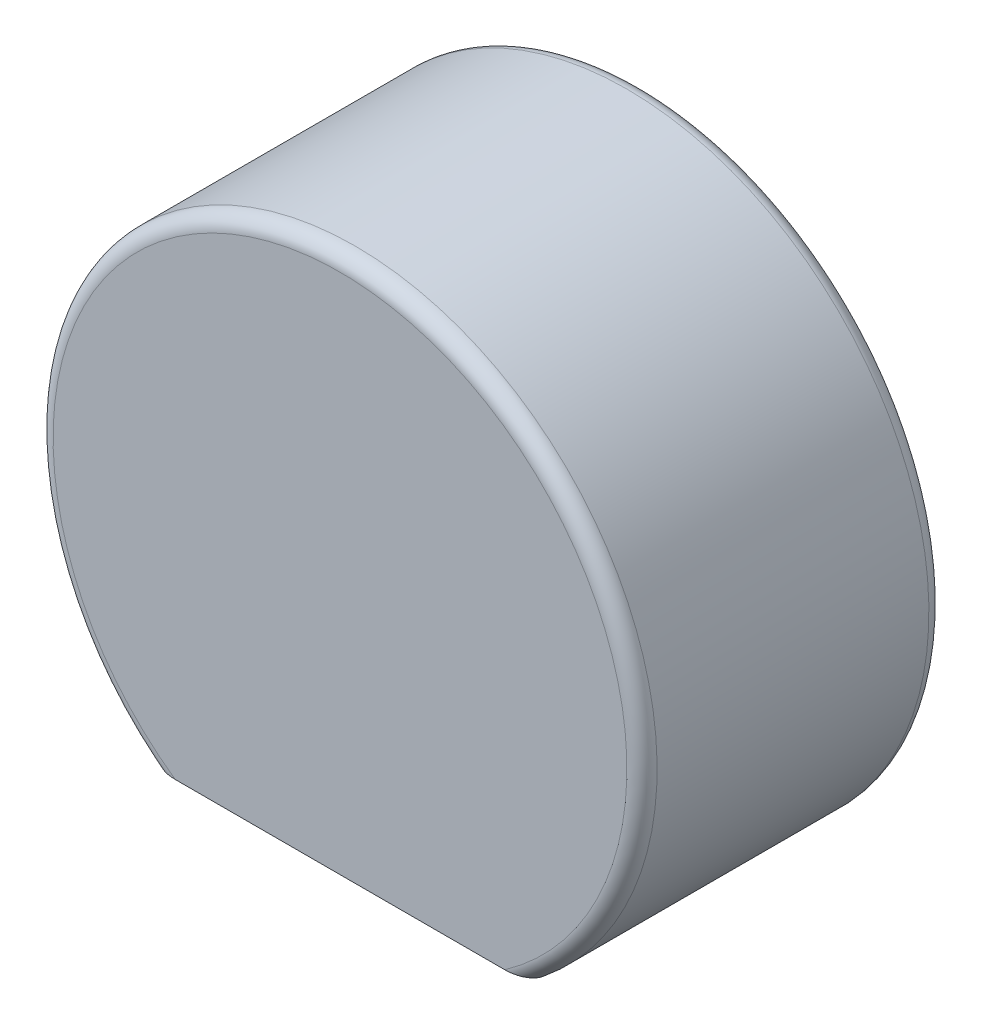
from build123d import *

# Parameters (mm, degrees)
BOSS_EXTRUDE1_DEPTH = 20
FILLET1_R           = 1


with BuildPart() as part:
    # Sketch1 → Boss-Extrude1 (new body)
    with BuildSketch(Plane.XY):
        with BuildLine():
            Line((-12.570787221, -15.555555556), (12.570787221, -15.555555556))
            ThreePointArc((12.570787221, -15.555555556), (0, 20), (-12.570787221, -15.555555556))
        make_face()
    extrude(amount=BOSS_EXTRUDE1_DEPTH)

    # Fillet1
    fillet1_edges = [part.edges().sort_by_distance(p)[0] for p in [
        (0, 20, 0),
        (0, 20, 20),
    ]]
    fillet(fillet1_edges, radius=FILLET1_R)


solid = part.part
